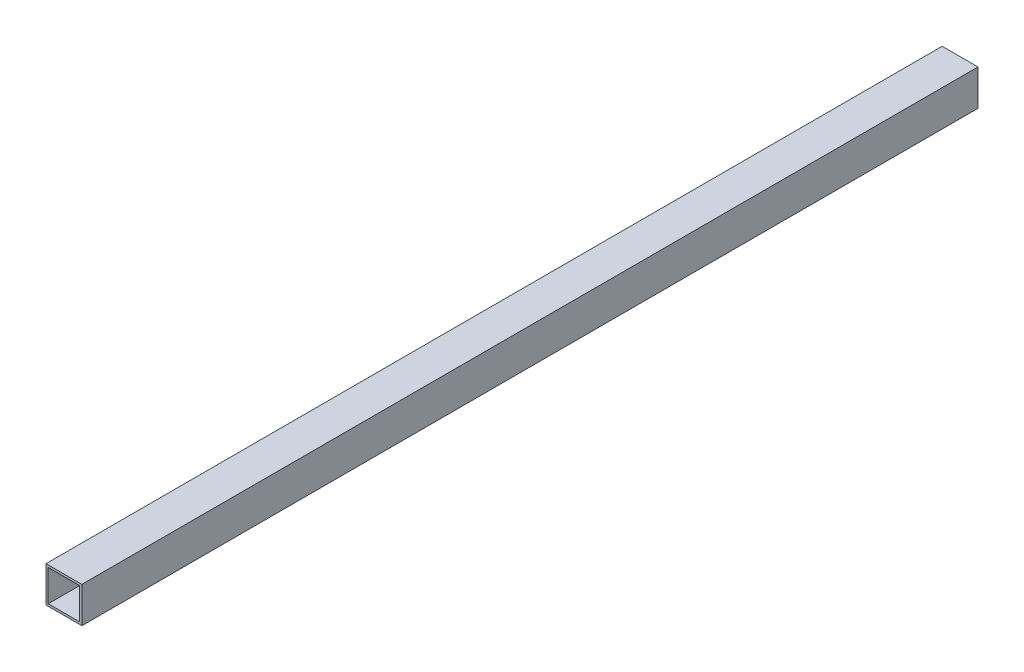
from build123d import *

# Parameters (mm, degrees)
ESQUISSE1_W             = 80
ESQUISSE1_H             = 80
ESQUISSE1_W_2           = 70
ESQUISSE1_H_2           = 70
BOSS_EXTRU_1_DEPTH      = 2100
ENL_V_MAT_EXTRU_1_DEPTH = 2102.90389885
ENL_V_MAT_EXTRU_2_DEPTH = 2006.995007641


with BuildPart() as part:
    # Esquisse1 → Boss.-Extru.1 (new body)
    with BuildSketch(Plane.XY):
        Rectangle(ESQUISSE1_W, ESQUISSE1_H)
        Rectangle(ESQUISSE1_W_2, ESQUISSE1_H_2, mode=Mode.SUBTRACT)
    extrude(amount=BOSS_EXTRU_1_DEPTH)

    # Esquisse2 → Enl_v. mat.-Extru.1 (cut, through all)
    with BuildSketch(Plane(origin=(40, 0, 0), x_dir=(0, 0, -1), z_dir=(1, 0, 0))):
        Polygon((-2000, -40), (-2005.175030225, 63.500793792), (-2124.761720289, 65.576705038), (-2118.342133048, -62.815274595), align=None)
    extrude(amount=-ENL_V_MAT_EXTRU_1_DEPTH, mode=Mode.SUBTRACT)

    # Esquisse3 → Enl_v. mat.-Extru.2 (cut, through all)
    with BuildSketch(Plane(origin=(40, 0, 0), x_dir=(0, 0, -1), z_dir=(1, 0, 0))):
        Polygon((-2000, -40), (-2003.999992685, 40), (-2000, 40), align=None)
    extrude(amount=-ENL_V_MAT_EXTRU_2_DEPTH, mode=Mode.SUBTRACT)


solid = part.part
